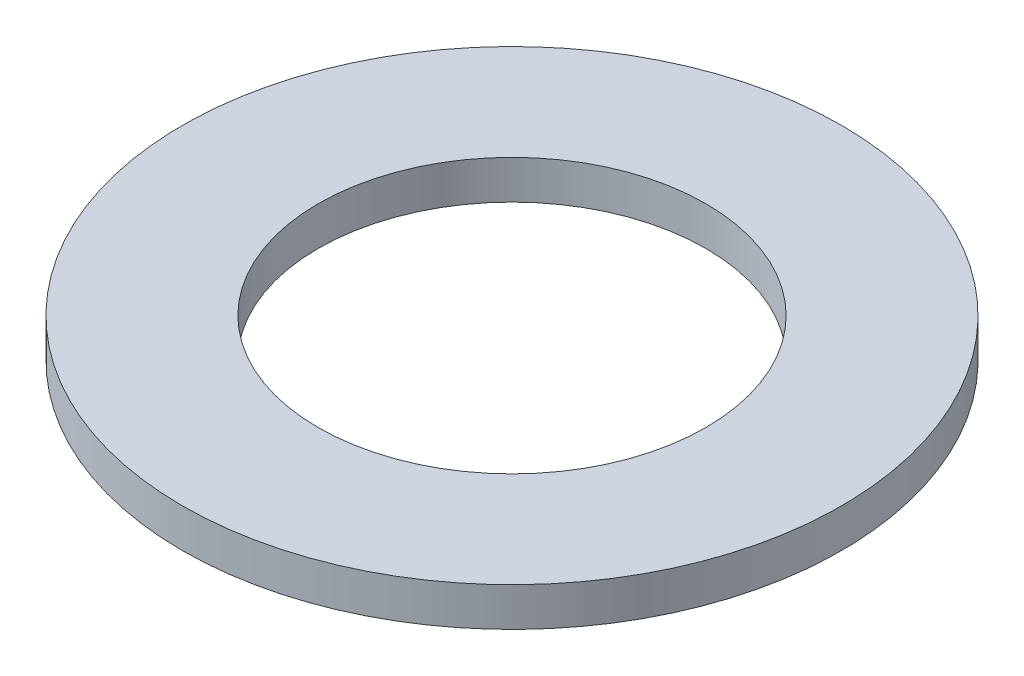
ISO-10303-21;
HEADER;
FILE_DESCRIPTION(('STEP AP214'),'2;1');
FILE_NAME('part.step','',(''),(''),'','','');
FILE_SCHEMA(('AUTOMOTIVE_DESIGN { 1 0 10303 214 1 1 1 1 }'));
ENDSEC;
DATA;
#1=APPLICATION_CONTEXT('core data for automotive mechanical design processes');
#2=APPLICATION_PROTOCOL_DEFINITION('international standard','automotive_design',2000,#1);
#3=PRODUCT_CONTEXT('',#1,'mechanical');
#4=PRODUCT('Part','Part','',(#3));
#5=PRODUCT_RELATED_PRODUCT_CATEGORY('part','',(#4));
#6=PRODUCT_DEFINITION_FORMATION('','',#4);
#7=PRODUCT_DEFINITION_CONTEXT('part definition',#1,'design');
#8=PRODUCT_DEFINITION('design','',#6,#7);
#9=PRODUCT_DEFINITION_SHAPE('','',#8);
#10=(LENGTH_UNIT() NAMED_UNIT(*) SI_UNIT(.MILLI.,.METRE.));
#11=(NAMED_UNIT(*) PLANE_ANGLE_UNIT() SI_UNIT($,.RADIAN.));
#12=(NAMED_UNIT(*) SI_UNIT($,.STERADIAN.) SOLID_ANGLE_UNIT());
#13=UNCERTAINTY_MEASURE_WITH_UNIT(LENGTH_MEASURE(1.E-05),#10,'distance_accuracy_value','');
#14=(GEOMETRIC_REPRESENTATION_CONTEXT(3) GLOBAL_UNCERTAINTY_ASSIGNED_CONTEXT((#13)) GLOBAL_UNIT_ASSIGNED_CONTEXT((#10,
#11,#12)) REPRESENTATION_CONTEXT('',''));
#15=CARTESIAN_POINT('',(0.,0.,0.));
#16=DIRECTION('',(0.,0.,1.));
#17=DIRECTION('',(1.,0.,0.));
#18=AXIS2_PLACEMENT_3D('',#15,#16,#17);
#19=CARTESIAN_POINT('',(0.,1.,0.));
#20=DIRECTION('',(0.,1.,0.));
#21=DIRECTION('',(0.,0.,1.));
#22=AXIS2_PLACEMENT_3D('',#19,#20,#21);
#23=PLANE('',#22);
#24=CARTESIAN_POINT('',(0.,1.,0.));
#25=DIRECTION('',(0.,1.,0.));
#26=DIRECTION('',(0.,0.,1.));
#27=AXIS2_PLACEMENT_3D('',#24,#25,#26);
#28=CIRCLE('',#27,8.5);
#29=CARTESIAN_POINT('',(0.,1.,8.5));
#30=VERTEX_POINT('',#29);
#31=EDGE_CURVE('E10',#30,#30,#28,.T.);
#32=ORIENTED_EDGE('',*,*,#31,.T.);
#33=EDGE_LOOP('',(#32));
#34=FACE_BOUND('',#33,.T.);
#35=CARTESIAN_POINT('',(0.,1.,0.));
#36=DIRECTION('',(0.,1.,0.));
#37=DIRECTION('',(0.,0.,1.));
#38=AXIS2_PLACEMENT_3D('',#35,#36,#37);
#39=CIRCLE('',#38,5.);
#40=CARTESIAN_POINT('',(0.,1.,5.));
#41=VERTEX_POINT('',#40);
#42=EDGE_CURVE('E42',#41,#41,#39,.T.);
#43=ORIENTED_EDGE('',*,*,#42,.F.);
#44=EDGE_LOOP('',(#43));
#45=FACE_BOUND('',#44,.T.);
#46=ADVANCED_FACE('F31',(#34,#45),#23,.T.);
#47=CARTESIAN_POINT('',(0.,0.,0.));
#48=DIRECTION('',(0.,1.,0.));
#49=DIRECTION('',(0.,0.,1.));
#50=AXIS2_PLACEMENT_3D('',#47,#48,#49);
#51=PLANE('',#50);
#52=CARTESIAN_POINT('',(0.,0.,0.));
#53=DIRECTION('',(0.,1.,0.));
#54=DIRECTION('',(0.,0.,1.));
#55=AXIS2_PLACEMENT_3D('',#52,#53,#54);
#56=CIRCLE('',#55,8.5);
#57=CARTESIAN_POINT('',(0.,0.,8.5));
#58=VERTEX_POINT('',#57);
#59=EDGE_CURVE('E35',#58,#58,#56,.T.);
#60=ORIENTED_EDGE('',*,*,#59,.F.);
#61=EDGE_LOOP('',(#60));
#62=FACE_BOUND('',#61,.T.);
#63=CARTESIAN_POINT('',(0.,0.,0.));
#64=DIRECTION('',(0.,1.,0.));
#65=DIRECTION('',(0.,0.,1.));
#66=AXIS2_PLACEMENT_3D('',#63,#64,#65);
#67=CIRCLE('',#66,5.);
#68=CARTESIAN_POINT('',(0.,0.,5.));
#69=VERTEX_POINT('',#68);
#70=EDGE_CURVE('E44',#69,#69,#67,.T.);
#71=ORIENTED_EDGE('',*,*,#70,.T.);
#72=EDGE_LOOP('',(#71));
#73=FACE_BOUND('',#72,.T.);
#74=ADVANCED_FACE('F54',(#62,#73),#51,.F.);
#75=CARTESIAN_POINT('',(0.,1.,0.));
#76=DIRECTION('',(0.,-1.,0.));
#77=DIRECTION('',(0.,0.,-1.));
#78=AXIS2_PLACEMENT_3D('',#75,#76,#77);
#79=CYLINDRICAL_SURFACE('',#78,8.5);
#80=ORIENTED_EDGE('',*,*,#31,.F.);
#81=EDGE_LOOP('',(#80));
#82=FACE_BOUND('',#81,.T.);
#83=ORIENTED_EDGE('',*,*,#59,.T.);
#84=EDGE_LOOP('',(#83));
#85=FACE_BOUND('',#84,.T.);
#86=ADVANCED_FACE('F33',(#82,#85),#79,.T.);
#87=CARTESIAN_POINT('',(0.,1.,0.));
#88=DIRECTION('',(0.,-1.,0.));
#89=DIRECTION('',(0.,0.,-1.));
#90=AXIS2_PLACEMENT_3D('',#87,#88,#89);
#91=CYLINDRICAL_SURFACE('',#90,5.);
#92=ORIENTED_EDGE('',*,*,#42,.T.);
#93=EDGE_LOOP('',(#92));
#94=FACE_BOUND('',#93,.T.);
#95=ORIENTED_EDGE('',*,*,#70,.F.);
#96=EDGE_LOOP('',(#95));
#97=FACE_BOUND('',#96,.T.);
#98=ADVANCED_FACE('F50',(#94,#97),#91,.F.);
#99=CLOSED_SHELL('',(#46,#74,#86,#98));
#100=MANIFOLD_SOLID_BREP('B2',#99);
#101=ADVANCED_BREP_SHAPE_REPRESENTATION('',(#18,#100),#14);
#102=SHAPE_DEFINITION_REPRESENTATION(#9,#101);
ENDSEC;
END-ISO-10303-21;
